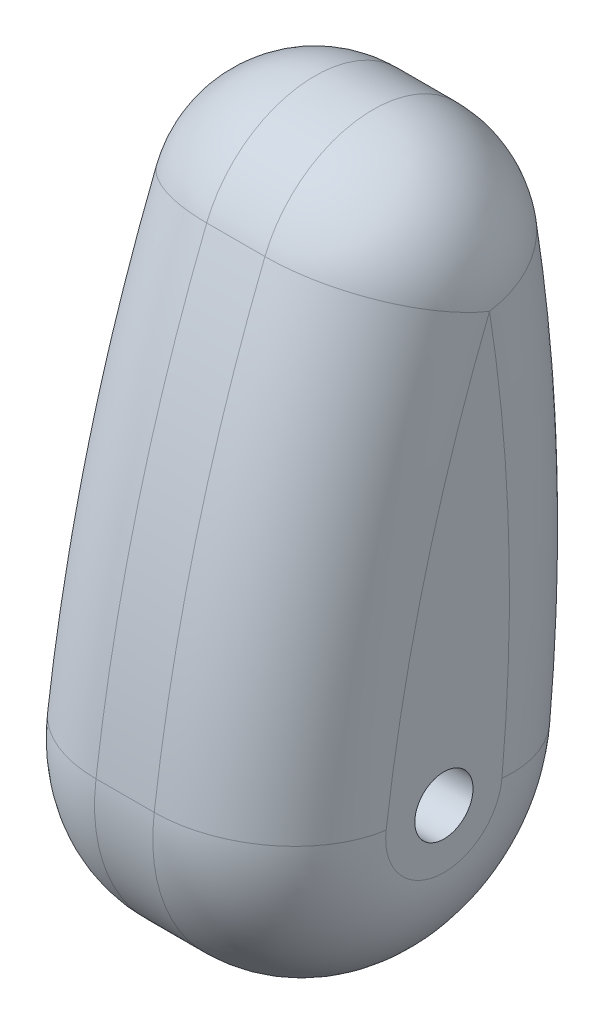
from build123d import *

# Parameters (mm, degrees)
BASE_EXTRUDE_DEPTH = 63.5
FILLET1_R          = 50.8
SKETCH9_R          = 12.7
CUT_EXTRUDE1_DEPTH = 448.227534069


with BuildPart() as part:
    # Sketch8 → Base-Extrude (new, symmetric)
    with BuildSketch(Plane(origin=(0, 0, 0), x_dir=(0, 0, -1), z_dir=(1, 0, 0))):
        with BuildLine():
            ThreePointArc((-69.637611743, 202.48222577), (-2.581676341, 117.03801616), (81.787388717, 185.441760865))
            ThreePointArc((81.787388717, 185.441760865), (84.963831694, 281.584095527), (76.002168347, 377.360537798))
            ThreePointArc((76.002168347, 377.360537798), (31.50354767, 419.926176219), (-21.342474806, 388.31512238))
            ThreePointArc((-21.342474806, 388.31512238), (-51.366642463, 296.925912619), (-69.637611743, 202.48222577))
        make_face()
    extrude(amount=BASE_EXTRUDE_DEPTH, both=True)

    # Fillet1
    fillet1_edges = [part.edges().sort_by_distance(p)[0] for p in [
        (-63.5, 117.03801616, 2.581676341),
        (63.5, 117.03801616, 2.581676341),
        (-63.5, 296.925912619, 51.366642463),
        (63.5, 296.925912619, 51.366642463),
        (-63.5, 419.926176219, -31.50354767),
        (63.5, 419.926176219, -31.50354767),
        (63.5, 281.584095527, -84.963831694),
        (-63.5, 281.584095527, -84.963831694),
    ]]
    fillet(fillet1_edges, radius=FILLET1_R)

    # Sketch9 → Cut-Extrude1 (cut, through all)
    with BuildSketch(Plane.ZY.offset(63.5)):
        with Locations((-5.939629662, 192.760056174)):
            Circle(SKETCH9_R)
    extrude(amount=-CUT_EXTRUDE1_DEPTH, mode=Mode.SUBTRACT)


solid = part.part
